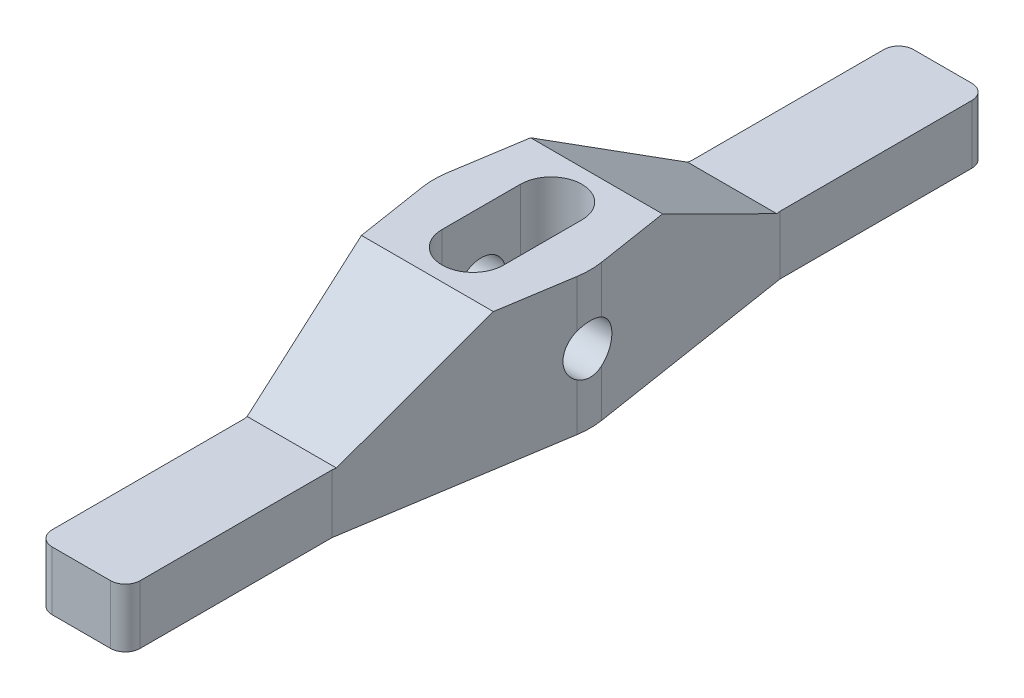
ISO-10303-21;
HEADER;
FILE_DESCRIPTION(('STEP AP214'),'2;1');
FILE_NAME('part.step','',(''),(''),'','','');
FILE_SCHEMA(('AUTOMOTIVE_DESIGN { 1 0 10303 214 1 1 1 1 }'));
ENDSEC;
DATA;
#1=APPLICATION_CONTEXT('core data for automotive mechanical design processes');
#2=APPLICATION_PROTOCOL_DEFINITION('international standard','automotive_design',2000,#1);
#3=PRODUCT_CONTEXT('',#1,'mechanical');
#4=PRODUCT('Part','Part','',(#3));
#5=PRODUCT_RELATED_PRODUCT_CATEGORY('part','',(#4));
#6=PRODUCT_DEFINITION_FORMATION('','',#4);
#7=PRODUCT_DEFINITION_CONTEXT('part definition',#1,'design');
#8=PRODUCT_DEFINITION('design','',#6,#7);
#9=PRODUCT_DEFINITION_SHAPE('','',#8);
#10=(LENGTH_UNIT() NAMED_UNIT(*) SI_UNIT(.MILLI.,.METRE.));
#11=(NAMED_UNIT(*) PLANE_ANGLE_UNIT() SI_UNIT($,.RADIAN.));
#12=(NAMED_UNIT(*) SI_UNIT($,.STERADIAN.) SOLID_ANGLE_UNIT());
#13=UNCERTAINTY_MEASURE_WITH_UNIT(LENGTH_MEASURE(1.E-05),#10,'distance_accuracy_value','');
#14=(GEOMETRIC_REPRESENTATION_CONTEXT(3) GLOBAL_UNCERTAINTY_ASSIGNED_CONTEXT((#13)) GLOBAL_UNIT_ASSIGNED_CONTEXT((#10,
#11,#12)) REPRESENTATION_CONTEXT('',''));
#15=CARTESIAN_POINT('',(0.,0.,0.));
#16=DIRECTION('',(0.,0.,1.));
#17=DIRECTION('',(1.,0.,0.));
#18=AXIS2_PLACEMENT_3D('',#15,#16,#17);
#19=CARTESIAN_POINT('',(0.,44.45,0.));
#20=DIRECTION('',(0.,-1.,0.));
#21=DIRECTION('',(0.,0.,-1.));
#22=AXIS2_PLACEMENT_3D('',#19,#20,#21);
#23=CYLINDRICAL_SURFACE('',#22,25.4);
#24=DIRECTION('',(0.,-1.,0.));
#25=VECTOR('',#24,1.);
#26=CARTESIAN_POINT('',(-25.0913666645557,44.45,3.94757126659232));
#27=LINE('',#26,#25);
#28=CARTESIAN_POINT('',(-25.0913666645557,15.3460595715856,3.94757126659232));
#29=VERTEX_POINT('',#28);
#30=CARTESIAN_POINT('',(-25.0913666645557,0.,3.94757126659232));
#31=VERTEX_POINT('',#30);
#32=EDGE_CURVE('E261',#29,#31,#27,.T.);
#33=ORIENTED_EDGE('',*,*,#32,.F.);
#34=CARTESIAN_POINT('',(-25.0913666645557,15.3460595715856,3.94757126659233));
#35=CARTESIAN_POINT('',(-25.1207433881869,15.2389469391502,3.7609603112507));
#36=CARTESIAN_POINT('',(-25.1486702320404,15.1393573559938,3.56978635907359));
#37=CARTESIAN_POINT('',(-25.2009729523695,14.9558828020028,3.17954184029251));
#38=CARTESIAN_POINT('',(-25.2253482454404,14.872000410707,2.98046998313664));
#39=CARTESIAN_POINT('',(-25.2698809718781,14.7206534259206,2.57577211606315));
#40=CARTESIAN_POINT('',(-25.2900394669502,14.6531846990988,2.37014777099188));
#41=CARTESIAN_POINT('',(-25.3256133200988,14.5352010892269,1.9537038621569));
#42=CARTESIAN_POINT('',(-25.3410290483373,14.4846848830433,1.74288470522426));
#43=CARTESIAN_POINT('',(-25.3667212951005,14.4009806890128,1.31718967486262));
#44=CARTESIAN_POINT('',(-25.376990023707,14.367818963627,1.10230816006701));
#45=CARTESIAN_POINT('',(-25.392072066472,14.3192426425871,0.670354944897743));
#46=CARTESIAN_POINT('',(-25.3968853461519,14.3038281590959,0.453283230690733));
#47=CARTESIAN_POINT('',(-25.4009230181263,14.290892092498,0.0185911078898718));
#48=CARTESIAN_POINT('',(-25.400148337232,14.2933675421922,-0.199029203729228));
#49=CARTESIAN_POINT('',(-25.3930337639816,14.316180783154,-0.63322798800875));
#50=CARTESIAN_POINT('',(-25.3866941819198,14.3365175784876,-0.849806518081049));
#51=CARTESIAN_POINT('',(-25.3687913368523,14.3943262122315,-1.27638845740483));
#52=CARTESIAN_POINT('',(-25.3573259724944,14.4314770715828,-1.4864396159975));
#53=CARTESIAN_POINT('',(-25.3295036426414,14.5224828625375,-1.90255781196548));
#54=CARTESIAN_POINT('',(-25.3131467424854,14.5763375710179,-2.10862490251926));
#55=CARTESIAN_POINT('',(-25.2759897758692,14.7002219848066,-2.51514697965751));
#56=CARTESIAN_POINT('',(-25.2551949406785,14.7702326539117,-2.71560826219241));
#57=CARTESIAN_POINT('',(-25.2096885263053,14.9258856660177,-3.10981332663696));
#58=CARTESIAN_POINT('',(-25.1849789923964,15.0115198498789,-3.3035605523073));
#59=CARTESIAN_POINT('',(-25.147921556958,15.1424573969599,-3.57045021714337));
#60=CARTESIAN_POINT('',(-25.1369446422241,15.1815191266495,-3.64690066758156));
#61=CARTESIAN_POINT('',(-25.1145090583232,15.2620123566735,-3.7983260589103));
#62=CARTESIAN_POINT('',(-25.1030511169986,15.3034403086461,-3.87330299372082));
#63=CARTESIAN_POINT('',(-25.0913666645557,15.3460595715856,-3.94757126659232));
#64=B_SPLINE_CURVE_WITH_KNOTS('',3,(#34,#35,#36,#37,#38,#39,#40,#41,#42,#43,#44,#45,#46,#47,#48,
#49,#50,#51,#52,#53,#54,#55,#56,#57,#58,#59,#60,#61,#62,#63),.UNSPECIFIED.,.F.,.F.,(4,2,2,2,2,2,
2,2,2,2,2,2,2,2,4),(0.,0.651329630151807,1.30276613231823,1.95403841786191,2.6052598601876,
3.25746396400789,3.90967218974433,4.56177224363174,5.21383593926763,5.85394509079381,
6.49404569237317,7.13339589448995,7.77241315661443,8.03202783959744,8.29126293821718),.UNSPECIFIED.);
#65=CARTESIAN_POINT('',(-25.0913666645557,15.3460595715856,-3.94757126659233));
#66=VERTEX_POINT('',#65);
#67=EDGE_CURVE('E406',#29,#66,#64,.T.);
#68=ORIENTED_EDGE('',*,*,#67,.T.);
#69=DIRECTION('',(0.,-1.,0.));
#70=VECTOR('',#69,1.);
#71=CARTESIAN_POINT('',(-25.0913666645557,44.45,-3.94757126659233));
#72=LINE('',#71,#70);
#73=CARTESIAN_POINT('',(-25.0913666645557,0.,-3.94757126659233));
#74=VERTEX_POINT('',#73);
#75=EDGE_CURVE('E265',#66,#74,#72,.T.);
#76=ORIENTED_EDGE('',*,*,#75,.T.);
#77=CARTESIAN_POINT('',(0.,0.,0.));
#78=DIRECTION('',(0.,1.,0.));
#79=DIRECTION('',(0.,0.,1.));
#80=AXIS2_PLACEMENT_3D('',#77,#78,#79);
#81=CIRCLE('',#80,25.4);
#82=EDGE_CURVE('E346',#74,#31,#81,.T.);
#83=ORIENTED_EDGE('',*,*,#82,.T.);
#84=EDGE_LOOP('',(#33,#68,#76,#83));
#85=FACE_BOUND('',#84,.T.);
#86=ADVANCED_FACE('F35',(#85),#23,.T.);
#87=CARTESIAN_POINT('',(0.,44.45,0.));
#88=DIRECTION('',(0.,-1.,0.));
#89=DIRECTION('',(0.,0.,-1.));
#90=AXIS2_PLACEMENT_3D('',#87,#88,#89);
#91=CYLINDRICAL_SURFACE('',#90,25.4);
#92=DIRECTION('',(0.,-1.,0.));
#93=VECTOR('',#92,1.);
#94=CARTESIAN_POINT('',(25.0913666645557,44.45,-3.94757126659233));
#95=LINE('',#94,#93);
#96=CARTESIAN_POINT('',(25.0913666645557,15.3460595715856,-3.94757126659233));
#97=VERTEX_POINT('',#96);
#98=CARTESIAN_POINT('',(25.0913666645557,0.,-3.94757126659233));
#99=VERTEX_POINT('',#98);
#100=EDGE_CURVE('E249',#97,#99,#95,.T.);
#101=ORIENTED_EDGE('',*,*,#100,.F.);
#102=CARTESIAN_POINT('',(25.0913666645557,15.3460595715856,-3.94757126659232));
#103=CARTESIAN_POINT('',(25.1207433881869,15.2389469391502,-3.76096031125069));
#104=CARTESIAN_POINT('',(25.1486702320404,15.1393573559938,-3.56978635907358));
#105=CARTESIAN_POINT('',(25.2009729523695,14.9558828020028,-3.1795418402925));
#106=CARTESIAN_POINT('',(25.2253482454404,14.872000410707,-2.98046998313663));
#107=CARTESIAN_POINT('',(25.2698809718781,14.7206534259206,-2.57577211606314));
#108=CARTESIAN_POINT('',(25.2900394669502,14.6531846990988,-2.37014777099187));
#109=CARTESIAN_POINT('',(25.3256133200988,14.5352010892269,-1.95370386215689));
#110=CARTESIAN_POINT('',(25.3410290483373,14.4846848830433,-1.74288470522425));
#111=CARTESIAN_POINT('',(25.3667212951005,14.4009806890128,-1.31718967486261));
#112=CARTESIAN_POINT('',(25.376990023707,14.367818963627,-1.102308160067));
#113=CARTESIAN_POINT('',(25.392072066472,14.3192426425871,-0.670354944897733));
#114=CARTESIAN_POINT('',(25.3968853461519,14.3038281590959,-0.453283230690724));
#115=CARTESIAN_POINT('',(25.4009230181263,14.290892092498,-0.0185911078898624));
#116=CARTESIAN_POINT('',(25.400148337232,14.2933675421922,0.199029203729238));
#117=CARTESIAN_POINT('',(25.3930337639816,14.316180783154,0.63322798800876));
#118=CARTESIAN_POINT('',(25.3866941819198,14.3365175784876,0.849806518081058));
#119=CARTESIAN_POINT('',(25.3687913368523,14.3943262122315,1.27638845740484));
#120=CARTESIAN_POINT('',(25.3573259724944,14.4314770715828,1.48643961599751));
#121=CARTESIAN_POINT('',(25.3295036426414,14.5224828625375,1.90255781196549));
#122=CARTESIAN_POINT('',(25.3131467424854,14.5763375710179,2.10862490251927));
#123=CARTESIAN_POINT('',(25.2759897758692,14.7002219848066,2.51514697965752));
#124=CARTESIAN_POINT('',(25.2551949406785,14.7702326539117,2.71560826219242));
#125=CARTESIAN_POINT('',(25.2096885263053,14.9258856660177,3.10981332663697));
#126=CARTESIAN_POINT('',(25.1849789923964,15.0115198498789,3.30356055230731));
#127=CARTESIAN_POINT('',(25.147921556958,15.1424573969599,3.57045021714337));
#128=CARTESIAN_POINT('',(25.1369446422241,15.1815191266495,3.64690066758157));
#129=CARTESIAN_POINT('',(25.1145090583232,15.2620123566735,3.79832605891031));
#130=CARTESIAN_POINT('',(25.1030511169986,15.3034403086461,3.87330299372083));
#131=CARTESIAN_POINT('',(25.0913666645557,15.3460595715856,3.94757126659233));
#132=B_SPLINE_CURVE_WITH_KNOTS('',3,(#102,#103,#104,#105,#106,#107,#108,#109,#110,#111,#112,
#113,#114,#115,#116,#117,#118,#119,#120,#121,#122,#123,#124,#125,#126,#127,#128,#129,#130,#131),
.UNSPECIFIED.,.F.,.F.,(4,2,2,2,2,2,2,2,2,2,2,2,2,2,4),(0.,0.651329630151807,1.30276613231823,
1.95403841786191,2.6052598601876,3.25746396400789,3.90967218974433,4.56177224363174,
5.21383593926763,5.85394509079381,6.49404569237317,7.13339589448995,7.77241315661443,
8.03202783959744,8.29126293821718),.UNSPECIFIED.);
#133=CARTESIAN_POINT('',(25.0913666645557,15.3460595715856,3.94757126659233));
#134=VERTEX_POINT('',#133);
#135=EDGE_CURVE('E235',#97,#134,#132,.T.);
#136=ORIENTED_EDGE('',*,*,#135,.T.);
#137=DIRECTION('',(0.,-1.,0.));
#138=VECTOR('',#137,1.);
#139=CARTESIAN_POINT('',(25.0913666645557,44.45,3.94757126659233));
#140=LINE('',#139,#138);
#141=CARTESIAN_POINT('',(25.0913666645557,0.,3.94757126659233));
#142=VERTEX_POINT('',#141);
#143=EDGE_CURVE('E248',#134,#142,#140,.T.);
#144=ORIENTED_EDGE('',*,*,#143,.T.);
#145=CARTESIAN_POINT('',(0.,0.,0.));
#146=DIRECTION('',(0.,1.,0.));
#147=DIRECTION('',(0.,0.,1.));
#148=AXIS2_PLACEMENT_3D('',#145,#146,#147);
#149=CIRCLE('',#148,25.4);
#150=EDGE_CURVE('E354',#142,#99,#149,.T.);
#151=ORIENTED_EDGE('',*,*,#150,.T.);
#152=EDGE_LOOP('',(#101,#136,#144,#151));
#153=FACE_BOUND('',#152,.T.);
#154=ADVANCED_FACE('F449',(#153),#91,.T.);
#155=CARTESIAN_POINT('',(0.,44.45,0.));
#156=DIRECTION('',(0.,1.,0.));
#157=DIRECTION('',(0.,0.,1.));
#158=AXIS2_PLACEMENT_3D('',#155,#156,#157);
#159=PLANE('',#158);
#160=DIRECTION('',(1.,0.,0.));
#161=VECTOR('',#160,1.);
#162=CARTESIAN_POINT('',(-25.4,44.45,27.432));
#163=LINE('',#162,#161);
#164=CARTESIAN_POINT('',(-21.3966115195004,44.45,27.432));
#165=VERTEX_POINT('',#164);
#166=CARTESIAN_POINT('',(21.3966115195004,44.45,27.432));
#167=VERTEX_POINT('',#166);
#168=EDGE_CURVE('E328',#165,#167,#163,.T.);
#169=ORIENTED_EDGE('',*,*,#168,.T.);
#170=DIRECTION('',(0.155416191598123,0.,-0.987849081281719));
#171=VECTOR('',#170,1.);
#172=CARTESIAN_POINT('',(14.2875,44.45,72.6186));
#173=LINE('',#172,#171);
#174=CARTESIAN_POINT('',(25.0913666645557,44.45,3.94757126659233));
#175=VERTEX_POINT('',#174);
#176=EDGE_CURVE('E376',#167,#175,#173,.T.);
#177=ORIENTED_EDGE('',*,*,#176,.T.);
#178=CARTESIAN_POINT('',(0.,44.45,0.));
#179=DIRECTION('',(0.,1.,0.));
#180=DIRECTION('',(0.,0.,1.));
#181=AXIS2_PLACEMENT_3D('',#178,#179,#180);
#182=CIRCLE('',#181,25.4);
#183=CARTESIAN_POINT('',(25.0913666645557,44.45,-3.94757126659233));
#184=VERTEX_POINT('',#183);
#185=EDGE_CURVE('E378',#175,#184,#182,.T.);
#186=ORIENTED_EDGE('',*,*,#185,.T.);
#187=DIRECTION('',(-0.155416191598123,0.,-0.987849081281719));
#188=VECTOR('',#187,1.);
#189=CARTESIAN_POINT('',(14.2875,44.45,-72.6186));
#190=LINE('',#189,#188);
#191=CARTESIAN_POINT('',(21.3966115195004,44.45,-27.432));
#192=VERTEX_POINT('',#191);
#193=EDGE_CURVE('E247',#184,#192,#190,.T.);
#194=ORIENTED_EDGE('',*,*,#193,.T.);
#195=DIRECTION('',(1.,0.,0.));
#196=VECTOR('',#195,1.);
#197=CARTESIAN_POINT('',(-25.4,44.45,-27.432));
#198=LINE('',#197,#196);
#199=CARTESIAN_POINT('',(-21.3966115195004,44.45,-27.432));
#200=VERTEX_POINT('',#199);
#201=EDGE_CURVE('E507',#200,#192,#198,.T.);
#202=ORIENTED_EDGE('',*,*,#201,.F.);
#203=DIRECTION('',(-0.155416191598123,0.,0.987849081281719));
#204=VECTOR('',#203,1.);
#205=CARTESIAN_POINT('',(-14.2875,44.45,-72.6186));
#206=LINE('',#205,#204);
#207=CARTESIAN_POINT('',(-25.0913666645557,44.45,-3.94757126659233));
#208=VERTEX_POINT('',#207);
#209=EDGE_CURVE('E358',#200,#208,#206,.T.);
#210=ORIENTED_EDGE('',*,*,#209,.T.);
#211=CARTESIAN_POINT('',(0.,44.45,0.));
#212=DIRECTION('',(0.,1.,0.));
#213=DIRECTION('',(0.,0.,1.));
#214=AXIS2_PLACEMENT_3D('',#211,#212,#213);
#215=CIRCLE('',#214,25.4);
#216=CARTESIAN_POINT('',(-25.0913666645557,44.45,3.94757126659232));
#217=VERTEX_POINT('',#216);
#218=EDGE_CURVE('E362',#208,#217,#215,.T.);
#219=ORIENTED_EDGE('',*,*,#218,.T.);
#220=DIRECTION('',(0.155416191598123,0.,0.987849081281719));
#221=VECTOR('',#220,1.);
#222=CARTESIAN_POINT('',(-14.2875,44.45,72.6186));
#223=LINE('',#222,#221);
#224=EDGE_CURVE('E368',#217,#165,#223,.T.);
#225=ORIENTED_EDGE('',*,*,#224,.T.);
#226=EDGE_LOOP('',(#169,#177,#186,#194,#202,#210,#219,#225));
#227=FACE_BOUND('',#226,.T.);
#228=DIRECTION('',(0.,0.,1.));
#229=VECTOR('',#228,1.);
#230=CARTESIAN_POINT('',(-9.9949,44.45,-12.7));
#231=LINE('',#230,#229);
#232=CARTESIAN_POINT('',(-9.9949,44.45,-12.7));
#233=VERTEX_POINT('',#232);
#234=CARTESIAN_POINT('',(-9.9949,44.45,12.7));
#235=VERTEX_POINT('',#234);
#236=EDGE_CURVE('E524',#233,#235,#231,.T.);
#237=ORIENTED_EDGE('',*,*,#236,.F.);
#238=CARTESIAN_POINT('',(0.,44.45,-12.7));
#239=DIRECTION('',(0.,1.,0.));
#240=DIRECTION('',(0.,0.,1.));
#241=AXIS2_PLACEMENT_3D('',#238,#239,#240);
#242=CIRCLE('',#241,9.9949);
#243=CARTESIAN_POINT('',(9.9949,44.45,-12.7));
#244=VERTEX_POINT('',#243);
#245=EDGE_CURVE('E522',#244,#233,#242,.T.);
#246=ORIENTED_EDGE('',*,*,#245,.F.);
#247=DIRECTION('',(0.,0.,-1.));
#248=VECTOR('',#247,1.);
#249=CARTESIAN_POINT('',(9.9949,44.45,-12.7));
#250=LINE('',#249,#248);
#251=CARTESIAN_POINT('',(9.9949,44.45,12.7));
#252=VERTEX_POINT('',#251);
#253=EDGE_CURVE('E530',#252,#244,#250,.T.);
#254=ORIENTED_EDGE('',*,*,#253,.F.);
#255=CARTESIAN_POINT('',(0.,44.45,12.7));
#256=DIRECTION('',(0.,1.,0.));
#257=DIRECTION('',(0.,0.,1.));
#258=AXIS2_PLACEMENT_3D('',#255,#256,#257);
#259=CIRCLE('',#258,9.9949);
#260=EDGE_CURVE('E527',#235,#252,#259,.T.);
#261=ORIENTED_EDGE('',*,*,#260,.F.);
#262=EDGE_LOOP('',(#237,#246,#254,#261));
#263=FACE_BOUND('',#262,.T.);
#264=ADVANCED_FACE('F472',(#227,#263),#159,.T.);
#265=CARTESIAN_POINT('',(0.,0.,0.));
#266=DIRECTION('',(0.,1.,0.));
#267=DIRECTION('',(0.,0.,1.));
#268=AXIS2_PLACEMENT_3D('',#265,#266,#267);
#269=PLANE('',#268);
#270=DIRECTION('',(0.,0.,1.));
#271=VECTOR('',#270,1.);
#272=CARTESIAN_POINT('',(-14.2875,0.,-139.7));
#273=LINE('',#272,#271);
#274=CARTESIAN_POINT('',(-14.2875,0.,-134.874));
#275=VERTEX_POINT('',#274);
#276=CARTESIAN_POINT('',(-14.2875,0.,-72.6186));
#277=VERTEX_POINT('',#276);
#278=EDGE_CURVE('E387',#275,#277,#273,.T.);
#279=ORIENTED_EDGE('',*,*,#278,.F.);
#280=CARTESIAN_POINT('',(-9.4615,0.,-134.874));
#281=DIRECTION('',(0.,1.,0.));
#282=DIRECTION('',(0.,0.,1.));
#283=AXIS2_PLACEMENT_3D('',#280,#281,#282);
#284=CIRCLE('',#283,4.826);
#285=CARTESIAN_POINT('',(-9.4615,0.,-139.7));
#286=VERTEX_POINT('',#285);
#287=EDGE_CURVE('E295',#275,#286,#284,.F.);
#288=ORIENTED_EDGE('',*,*,#287,.T.);
#289=DIRECTION('',(-1.,0.,0.));
#290=VECTOR('',#289,1.);
#291=CARTESIAN_POINT('',(-14.2875,0.,-139.7));
#292=LINE('',#291,#290);
#293=CARTESIAN_POINT('',(9.4615,0.,-139.7));
#294=VERTEX_POINT('',#293);
#295=EDGE_CURVE('E384',#294,#286,#292,.T.);
#296=ORIENTED_EDGE('',*,*,#295,.F.);
#297=CARTESIAN_POINT('',(9.4615,0.,-134.874));
#298=DIRECTION('',(0.,1.,0.));
#299=DIRECTION('',(0.,0.,1.));
#300=AXIS2_PLACEMENT_3D('',#297,#298,#299);
#301=CIRCLE('',#300,4.826);
#302=CARTESIAN_POINT('',(14.2875,0.,-134.874));
#303=VERTEX_POINT('',#302);
#304=EDGE_CURVE('E293',#294,#303,#301,.F.);
#305=ORIENTED_EDGE('',*,*,#304,.T.);
#306=DIRECTION('',(0.,0.,-1.));
#307=VECTOR('',#306,1.);
#308=CARTESIAN_POINT('',(14.2875,0.,-139.7));
#309=LINE('',#308,#307);
#310=CARTESIAN_POINT('',(14.2875,0.,-72.6186));
#311=VERTEX_POINT('',#310);
#312=EDGE_CURVE('E381',#311,#303,#309,.T.);
#313=ORIENTED_EDGE('',*,*,#312,.F.);
#314=DIRECTION('',(-0.155416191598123,0.,-0.987849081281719));
#315=VECTOR('',#314,1.);
#316=CARTESIAN_POINT('',(14.2875,0.,-72.6186));
#317=LINE('',#316,#315);
#318=EDGE_CURVE('E356',#99,#311,#317,.T.);
#319=ORIENTED_EDGE('',*,*,#318,.F.);
#320=ORIENTED_EDGE('',*,*,#150,.F.);
#321=DIRECTION('',(0.155416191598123,0.,-0.987849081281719));
#322=VECTOR('',#321,1.);
#323=CARTESIAN_POINT('',(14.2875,0.,72.6186));
#324=LINE('',#323,#322);
#325=CARTESIAN_POINT('',(14.2875,0.,72.6186));
#326=VERTEX_POINT('',#325);
#327=EDGE_CURVE('E351',#326,#142,#324,.T.);
#328=ORIENTED_EDGE('',*,*,#327,.F.);
#329=DIRECTION('',(0.,0.,-1.));
#330=VECTOR('',#329,1.);
#331=CARTESIAN_POINT('',(14.2875,0.,139.7));
#332=LINE('',#331,#330);
#333=CARTESIAN_POINT('',(14.2875,0.,134.874));
#334=VERTEX_POINT('',#333);
#335=EDGE_CURVE('E344',#334,#326,#332,.T.);
#336=ORIENTED_EDGE('',*,*,#335,.F.);
#337=CARTESIAN_POINT('',(9.4615,0.,134.874));
#338=DIRECTION('',(0.,1.,0.));
#339=DIRECTION('',(0.,0.,1.));
#340=AXIS2_PLACEMENT_3D('',#337,#338,#339);
#341=CIRCLE('',#340,4.826);
#342=CARTESIAN_POINT('',(9.4615,0.,139.7));
#343=VERTEX_POINT('',#342);
#344=EDGE_CURVE('E289',#334,#343,#341,.F.);
#345=ORIENTED_EDGE('',*,*,#344,.T.);
#346=DIRECTION('',(1.,0.,0.));
#347=VECTOR('',#346,1.);
#348=CARTESIAN_POINT('',(-14.2875,0.,139.7));
#349=LINE('',#348,#347);
#350=CARTESIAN_POINT('',(-9.4615,0.,139.7));
#351=VERTEX_POINT('',#350);
#352=EDGE_CURVE('E338',#351,#343,#349,.T.);
#353=ORIENTED_EDGE('',*,*,#352,.F.);
#354=CARTESIAN_POINT('',(-9.4615,0.,134.874));
#355=DIRECTION('',(0.,1.,0.));
#356=DIRECTION('',(0.,0.,1.));
#357=AXIS2_PLACEMENT_3D('',#354,#355,#356);
#358=CIRCLE('',#357,4.826);
#359=CARTESIAN_POINT('',(-14.2875,0.,134.874));
#360=VERTEX_POINT('',#359);
#361=EDGE_CURVE('E291',#351,#360,#358,.F.);
#362=ORIENTED_EDGE('',*,*,#361,.T.);
#363=DIRECTION('',(0.,0.,1.));
#364=VECTOR('',#363,1.);
#365=CARTESIAN_POINT('',(-14.2875,0.,139.7));
#366=LINE('',#365,#364);
#367=CARTESIAN_POINT('',(-14.2875,0.,72.6186));
#368=VERTEX_POINT('',#367);
#369=EDGE_CURVE('E337',#368,#360,#366,.T.);
#370=ORIENTED_EDGE('',*,*,#369,.F.);
#371=DIRECTION('',(0.155416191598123,0.,0.987849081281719));
#372=VECTOR('',#371,1.);
#373=CARTESIAN_POINT('',(-14.2875,0.,72.6186));
#374=LINE('',#373,#372);
#375=EDGE_CURVE('E342',#31,#368,#374,.T.);
#376=ORIENTED_EDGE('',*,*,#375,.F.);
#377=ORIENTED_EDGE('',*,*,#82,.F.);
#378=DIRECTION('',(-0.155416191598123,0.,0.987849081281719));
#379=VECTOR('',#378,1.);
#380=CARTESIAN_POINT('',(-14.2875,0.,-72.6186));
#381=LINE('',#380,#379);
#382=EDGE_CURVE('E389',#277,#74,#381,.T.);
#383=ORIENTED_EDGE('',*,*,#382,.F.);
#384=EDGE_LOOP('',(#279,#288,#296,#305,#313,#319,#320,#328,#336,#345,#353,#362,#370,#376,#377,#383));
#385=FACE_BOUND('',#384,.T.);
#386=CARTESIAN_POINT('',(0.,0.,-12.7));
#387=DIRECTION('',(0.,1.,0.));
#388=DIRECTION('',(0.,0.,1.));
#389=AXIS2_PLACEMENT_3D('',#386,#387,#388);
#390=CIRCLE('',#389,9.9949);
#391=CARTESIAN_POINT('',(9.9949,0.,-12.7));
#392=VERTEX_POINT('',#391);
#393=CARTESIAN_POINT('',(-9.9949,0.,-12.7));
#394=VERTEX_POINT('',#393);
#395=EDGE_CURVE('E521',#392,#394,#390,.T.);
#396=ORIENTED_EDGE('',*,*,#395,.T.);
#397=DIRECTION('',(0.,0.,1.));
#398=VECTOR('',#397,1.);
#399=CARTESIAN_POINT('',(-9.9949,0.,-12.7));
#400=LINE('',#399,#398);
#401=CARTESIAN_POINT('',(-9.9949,0.,12.7));
#402=VERTEX_POINT('',#401);
#403=EDGE_CURVE('E535',#394,#402,#400,.T.);
#404=ORIENTED_EDGE('',*,*,#403,.T.);
#405=CARTESIAN_POINT('',(0.,0.,12.7));
#406=DIRECTION('',(0.,1.,0.));
#407=DIRECTION('',(0.,0.,1.));
#408=AXIS2_PLACEMENT_3D('',#405,#406,#407);
#409=CIRCLE('',#408,9.9949);
#410=CARTESIAN_POINT('',(9.9949,0.,12.7));
#411=VERTEX_POINT('',#410);
#412=EDGE_CURVE('E538',#402,#411,#409,.T.);
#413=ORIENTED_EDGE('',*,*,#412,.T.);
#414=DIRECTION('',(0.,0.,-1.));
#415=VECTOR('',#414,1.);
#416=CARTESIAN_POINT('',(9.9949,0.,-12.7));
#417=LINE('',#416,#415);
#418=EDGE_CURVE('E525',#411,#392,#417,.T.);
#419=ORIENTED_EDGE('',*,*,#418,.T.);
#420=EDGE_LOOP('',(#396,#404,#413,#419));
#421=FACE_BOUND('',#420,.T.);
#422=ADVANCED_FACE('F334',(#385,#421),#269,.F.);
#423=CARTESIAN_POINT('',(14.2875,44.45,-139.7));
#424=DIRECTION('',(-1.,0.,0.));
#425=DIRECTION('',(0.,0.,1.));
#426=AXIS2_PLACEMENT_3D('',#423,#424,#425);
#427=PLANE('',#426);
#428=ORIENTED_EDGE('',*,*,#312,.T.);
#429=DIRECTION('',(0.,-1.,0.));
#430=VECTOR('',#429,1.);
#431=CARTESIAN_POINT('',(14.2875,44.45,-134.874));
#432=LINE('',#431,#430);
#433=CARTESIAN_POINT('',(14.2875,19.05,-134.874));
#434=VERTEX_POINT('',#433);
#435=EDGE_CURVE('E306',#303,#434,#432,.F.);
#436=ORIENTED_EDGE('',*,*,#435,.T.);
#437=DIRECTION('',(0.,0.,1.));
#438=VECTOR('',#437,1.);
#439=CARTESIAN_POINT('',(14.2875,19.05,-139.7));
#440=LINE('',#439,#438);
#441=CARTESIAN_POINT('',(14.2875,19.05,-72.6186));
#442=VERTEX_POINT('',#441);
#443=EDGE_CURVE('E497',#434,#442,#440,.T.);
#444=ORIENTED_EDGE('',*,*,#443,.T.);
#445=DIRECTION('',(0.,-1.,0.));
#446=VECTOR('',#445,1.);
#447=CARTESIAN_POINT('',(14.2875,44.45,-72.6186));
#448=LINE('',#447,#446);
#449=EDGE_CURVE('E252',#442,#311,#448,.T.);
#450=ORIENTED_EDGE('',*,*,#449,.T.);
#451=EDGE_LOOP('',(#428,#436,#444,#450));
#452=FACE_BOUND('',#451,.T.);
#453=ADVANCED_FACE('F484',(#452),#427,.F.);
#454=CARTESIAN_POINT('',(-14.2875,44.45,-139.7));
#455=DIRECTION('',(0.,0.,1.));
#456=DIRECTION('',(1.,0.,0.));
#457=AXIS2_PLACEMENT_3D('',#454,#455,#456);
#458=PLANE('',#457);
#459=ORIENTED_EDGE('',*,*,#295,.T.);
#460=DIRECTION('',(0.,-1.,0.));
#461=VECTOR('',#460,1.);
#462=CARTESIAN_POINT('',(-9.4615,44.45,-139.7));
#463=LINE('',#462,#461);
#464=CARTESIAN_POINT('',(-9.4615,19.05,-139.7));
#465=VERTEX_POINT('',#464);
#466=EDGE_CURVE('E300',#286,#465,#463,.F.);
#467=ORIENTED_EDGE('',*,*,#466,.T.);
#468=DIRECTION('',(1.,0.,0.));
#469=VECTOR('',#468,1.);
#470=CARTESIAN_POINT('',(-25.4,19.05,-139.7));
#471=LINE('',#470,#469);
#472=CARTESIAN_POINT('',(9.4615,19.05,-139.7));
#473=VERTEX_POINT('',#472);
#474=EDGE_CURVE('E494',#465,#473,#471,.T.);
#475=ORIENTED_EDGE('',*,*,#474,.T.);
#476=DIRECTION('',(0.,-1.,0.));
#477=VECTOR('',#476,1.);
#478=CARTESIAN_POINT('',(9.4615,44.45,-139.7));
#479=LINE('',#478,#477);
#480=EDGE_CURVE('E297',#473,#294,#479,.T.);
#481=ORIENTED_EDGE('',*,*,#480,.T.);
#482=EDGE_LOOP('',(#459,#467,#475,#481));
#483=FACE_BOUND('',#482,.T.);
#484=ADVANCED_FACE('F499',(#483),#458,.F.);
#485=CARTESIAN_POINT('',(-14.2875,44.45,-139.7));
#486=DIRECTION('',(1.,0.,0.));
#487=DIRECTION('',(0.,0.,-1.));
#488=AXIS2_PLACEMENT_3D('',#485,#486,#487);
#489=PLANE('',#488);
#490=DIRECTION('',(0.,0.,-1.));
#491=VECTOR('',#490,1.);
#492=CARTESIAN_POINT('',(-14.2875,19.05,-139.7));
#493=LINE('',#492,#491);
#494=CARTESIAN_POINT('',(-14.2875,19.05,-72.6186));
#495=VERTEX_POINT('',#494);
#496=CARTESIAN_POINT('',(-14.2875,19.05,-134.874));
#497=VERTEX_POINT('',#496);
#498=EDGE_CURVE('E518',#495,#497,#493,.T.);
#499=ORIENTED_EDGE('',*,*,#498,.T.);
#500=DIRECTION('',(0.,-1.,0.));
#501=VECTOR('',#500,1.);
#502=CARTESIAN_POINT('',(-14.2875,44.45,-134.874));
#503=LINE('',#502,#501);
#504=EDGE_CURVE('E283',#497,#275,#503,.T.);
#505=ORIENTED_EDGE('',*,*,#504,.T.);
#506=ORIENTED_EDGE('',*,*,#278,.T.);
#507=DIRECTION('',(0.,-1.,0.));
#508=VECTOR('',#507,1.);
#509=CARTESIAN_POINT('',(-14.2875,44.45,-72.6186));
#510=LINE('',#509,#508);
#511=EDGE_CURVE('E269',#495,#277,#510,.T.);
#512=ORIENTED_EDGE('',*,*,#511,.F.);
#513=EDGE_LOOP('',(#499,#505,#506,#512));
#514=FACE_BOUND('',#513,.T.);
#515=ADVANCED_FACE('F587',(#514),#489,.F.);
#516=CARTESIAN_POINT('',(-14.2875,44.45,-72.6186));
#517=DIRECTION('',(0.987849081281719,0.,0.155416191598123));
#518=DIRECTION('',(0.155416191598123,0.,-0.987849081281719));
#519=AXIS2_PLACEMENT_3D('',#516,#517,#518);
#520=PLANE('',#519);
#521=ORIENTED_EDGE('',*,*,#75,.F.);
#522=CARTESIAN_POINT('',(-25.7124296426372,22.225,0.));
#523=DIRECTION('',(0.987849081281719,0.,0.155416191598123));
#524=DIRECTION('',(0.155416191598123,0.,-0.987849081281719));
#525=AXIS2_PLACEMENT_3D('',#522,#523,#524);
#526=ELLIPSE('',#525,8.02870615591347,7.93115);
#527=CARTESIAN_POINT('',(-25.0913666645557,29.1039404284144,-3.94757126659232));
#528=VERTEX_POINT('',#527);
#529=EDGE_CURVE('E615',#66,#528,#526,.T.);
#530=ORIENTED_EDGE('',*,*,#529,.T.);
#531=EDGE_CURVE('E266',#208,#528,#72,.T.);
#532=ORIENTED_EDGE('',*,*,#531,.F.);
#533=ORIENTED_EDGE('',*,*,#209,.F.);
#534=DIRECTION('',(0.135002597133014,-0.49542262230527,-0.858097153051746));
#535=VECTOR('',#534,1.);
#536=CARTESIAN_POINT('',(-16.0323857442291,24.7647579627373,-61.5278393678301));
#537=LINE('',#536,#535);
#538=CARTESIAN_POINT('',(-14.4751149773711,19.05,-71.4260905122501));
#539=VERTEX_POINT('',#538);
#540=EDGE_CURVE('E501',#200,#539,#537,.T.);
#541=ORIENTED_EDGE('',*,*,#540,.T.);
#542=DIRECTION('',(0.155416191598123,0.,-0.987849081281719));
#543=VECTOR('',#542,1.);
#544=CARTESIAN_POINT('',(-14.2875,19.05,-72.6186));
#545=LINE('',#544,#543);
#546=EDGE_CURVE('E515',#539,#495,#545,.T.);
#547=ORIENTED_EDGE('',*,*,#546,.T.);
#548=ORIENTED_EDGE('',*,*,#511,.T.);
#549=ORIENTED_EDGE('',*,*,#382,.T.);
#550=EDGE_LOOP('',(#521,#530,#532,#533,#541,#547,#548,#549));
#551=FACE_BOUND('',#550,.T.);
#552=ADVANCED_FACE('F466',(#551),#520,.F.);
#553=ORIENTED_EDGE('',*,*,#531,.T.);
#554=CARTESIAN_POINT('',(-25.0913666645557,29.1039404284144,-3.94757126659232));
#555=CARTESIAN_POINT('',(-25.1207433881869,29.2110530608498,-3.76096031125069));
#556=CARTESIAN_POINT('',(-25.1486702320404,29.3106426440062,-3.56978635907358));
#557=CARTESIAN_POINT('',(-25.2009729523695,29.4941171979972,-3.1795418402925));
#558=CARTESIAN_POINT('',(-25.2253482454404,29.577999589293,-2.98046998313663));
#559=CARTESIAN_POINT('',(-25.2698809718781,29.7293465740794,-2.57577211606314));
#560=CARTESIAN_POINT('',(-25.2900394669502,29.7968153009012,-2.37014777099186));
#561=CARTESIAN_POINT('',(-25.3256133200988,29.9147989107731,-1.95370386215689));
#562=CARTESIAN_POINT('',(-25.3410290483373,29.9653151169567,-1.74288470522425));
#563=CARTESIAN_POINT('',(-25.3667212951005,30.0490193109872,-1.31718967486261));
#564=CARTESIAN_POINT('',(-25.376990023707,30.082181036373,-1.102308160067));
#565=CARTESIAN_POINT('',(-25.392072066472,30.1307573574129,-0.67035494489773));
#566=CARTESIAN_POINT('',(-25.3968853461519,30.1461718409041,-0.45328323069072));
#567=CARTESIAN_POINT('',(-25.4009230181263,30.159107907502,-0.018591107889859));
#568=CARTESIAN_POINT('',(-25.400148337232,30.1566324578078,0.199029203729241));
#569=CARTESIAN_POINT('',(-25.3930337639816,30.133819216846,0.633227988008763));
#570=CARTESIAN_POINT('',(-25.3866941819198,30.1134824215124,0.849806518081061));
#571=CARTESIAN_POINT('',(-25.3687913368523,30.0556737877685,1.27638845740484));
#572=CARTESIAN_POINT('',(-25.3573259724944,30.0185229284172,1.48643961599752));
#573=CARTESIAN_POINT('',(-25.3295036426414,29.9275171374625,1.90255781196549));
#574=CARTESIAN_POINT('',(-25.3131467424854,29.8736624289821,2.10862490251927));
#575=CARTESIAN_POINT('',(-25.2759897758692,29.7497780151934,2.51514697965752));
#576=CARTESIAN_POINT('',(-25.2551949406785,29.6797673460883,2.71560826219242));
#577=CARTESIAN_POINT('',(-25.2096885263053,29.5241143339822,3.10981332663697));
#578=CARTESIAN_POINT('',(-25.1849789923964,29.4384801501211,3.30356055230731));
#579=CARTESIAN_POINT('',(-25.147921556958,29.3075426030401,3.57045021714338));
#580=CARTESIAN_POINT('',(-25.1369446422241,29.2684808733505,3.64690066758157));
#581=CARTESIAN_POINT('',(-25.1145090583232,29.1879876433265,3.79832605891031));
#582=CARTESIAN_POINT('',(-25.1030511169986,29.1465596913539,3.87330299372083));
#583=CARTESIAN_POINT('',(-25.0913666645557,29.1039404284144,3.94757126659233));
#584=B_SPLINE_CURVE_WITH_KNOTS('',3,(#554,#555,#556,#557,#558,#559,#560,#561,#562,#563,#564,
#565,#566,#567,#568,#569,#570,#571,#572,#573,#574,#575,#576,#577,#578,#579,#580,#581,#582,#583),
.UNSPECIFIED.,.F.,.F.,(4,2,2,2,2,2,2,2,2,2,2,2,2,2,4),(0.,0.651329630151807,1.30276613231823,
1.95403841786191,2.60525986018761,3.25746396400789,3.90967218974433,4.56177224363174,
5.21383593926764,5.85394509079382,6.49404569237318,7.13339589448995,7.77241315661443,
8.03202783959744,8.29126293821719),.UNSPECIFIED.);
#585=CARTESIAN_POINT('',(-25.0913666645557,29.1039404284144,3.94757126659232));
#586=VERTEX_POINT('',#585);
#587=EDGE_CURVE('E408',#528,#586,#584,.T.);
#588=ORIENTED_EDGE('',*,*,#587,.T.);
#589=EDGE_CURVE('E262',#217,#586,#27,.T.);
#590=ORIENTED_EDGE('',*,*,#589,.F.);
#591=ORIENTED_EDGE('',*,*,#218,.F.);
#592=EDGE_LOOP('',(#553,#588,#590,#591));
#593=FACE_BOUND('',#592,.T.);
#594=ADVANCED_FACE('F421',(#593),#23,.T.);
#595=CARTESIAN_POINT('',(-14.2875,44.45,72.6186));
#596=DIRECTION('',(0.987849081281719,0.,-0.155416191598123));
#597=DIRECTION('',(-0.155416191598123,0.,-0.987849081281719));
#598=AXIS2_PLACEMENT_3D('',#595,#596,#597);
#599=PLANE('',#598);
#600=ORIENTED_EDGE('',*,*,#589,.T.);
#601=CARTESIAN_POINT('',(-25.7124296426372,22.225,0.));
#602=DIRECTION('',(0.987849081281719,0.,-0.155416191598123));
#603=DIRECTION('',(0.155416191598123,0.,0.987849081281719));
#604=AXIS2_PLACEMENT_3D('',#601,#602,#603);
#605=ELLIPSE('',#604,8.02870615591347,7.93115);
#606=EDGE_CURVE('E402',#586,#29,#605,.T.);
#607=ORIENTED_EDGE('',*,*,#606,.T.);
#608=ORIENTED_EDGE('',*,*,#32,.T.);
#609=ORIENTED_EDGE('',*,*,#375,.T.);
#610=DIRECTION('',(0.,-1.,0.));
#611=VECTOR('',#610,1.);
#612=CARTESIAN_POINT('',(-14.2875,44.45,72.6186));
#613=LINE('',#612,#611);
#614=CARTESIAN_POINT('',(-14.2875,19.05,72.6186));
#615=VERTEX_POINT('',#614);
#616=EDGE_CURVE('E259',#615,#368,#613,.T.);
#617=ORIENTED_EDGE('',*,*,#616,.F.);
#618=DIRECTION('',(-0.155416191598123,0.,-0.987849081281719));
#619=VECTOR('',#618,1.);
#620=CARTESIAN_POINT('',(-14.2875,19.05,72.6186));
#621=LINE('',#620,#619);
#622=CARTESIAN_POINT('',(-14.4751149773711,19.05,71.4260905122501));
#623=VERTEX_POINT('',#622);
#624=EDGE_CURVE('E510',#615,#623,#621,.T.);
#625=ORIENTED_EDGE('',*,*,#624,.T.);
#626=DIRECTION('',(-0.135002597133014,0.49542262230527,-0.858097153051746));
#627=VECTOR('',#626,1.);
#628=CARTESIAN_POINT('',(-16.0323857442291,24.7647579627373,61.5278393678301));
#629=LINE('',#628,#627);
#630=EDGE_CURVE('E327',#623,#165,#629,.T.);
#631=ORIENTED_EDGE('',*,*,#630,.T.);
#632=ORIENTED_EDGE('',*,*,#224,.F.);
#633=EDGE_LOOP('',(#600,#607,#608,#609,#617,#625,#631,#632));
#634=FACE_BOUND('',#633,.T.);
#635=ADVANCED_FACE('F398',(#634),#599,.F.);
#636=CARTESIAN_POINT('',(-14.2875,44.45,139.7));
#637=DIRECTION('',(1.,0.,0.));
#638=DIRECTION('',(0.,0.,-1.));
#639=AXIS2_PLACEMENT_3D('',#636,#637,#638);
#640=PLANE('',#639);
#641=ORIENTED_EDGE('',*,*,#369,.T.);
#642=DIRECTION('',(0.,-1.,0.));
#643=VECTOR('',#642,1.);
#644=CARTESIAN_POINT('',(-14.2875,44.45,134.874));
#645=LINE('',#644,#643);
#646=CARTESIAN_POINT('',(-14.2875,19.05,134.874));
#647=VERTEX_POINT('',#646);
#648=EDGE_CURVE('E58',#360,#647,#645,.F.);
#649=ORIENTED_EDGE('',*,*,#648,.T.);
#650=DIRECTION('',(0.,0.,-1.));
#651=VECTOR('',#650,1.);
#652=CARTESIAN_POINT('',(-14.2875,19.05,139.7));
#653=LINE('',#652,#651);
#654=EDGE_CURVE('E319',#647,#615,#653,.T.);
#655=ORIENTED_EDGE('',*,*,#654,.T.);
#656=ORIENTED_EDGE('',*,*,#616,.T.);
#657=EDGE_LOOP('',(#641,#649,#655,#656));
#658=FACE_BOUND('',#657,.T.);
#659=ADVANCED_FACE('F339',(#658),#640,.F.);
#660=CARTESIAN_POINT('',(-14.2875,44.45,139.7));
#661=DIRECTION('',(0.,0.,-1.));
#662=DIRECTION('',(-1.,0.,0.));
#663=AXIS2_PLACEMENT_3D('',#660,#661,#662);
#664=PLANE('',#663);
#665=DIRECTION('',(1.,0.,0.));
#666=VECTOR('',#665,1.);
#667=CARTESIAN_POINT('',(-25.4,19.05,139.7));
#668=LINE('',#667,#666);
#669=CARTESIAN_POINT('',(-9.4615,19.05,139.7));
#670=VERTEX_POINT('',#669);
#671=CARTESIAN_POINT('',(9.4615,19.05,139.7));
#672=VERTEX_POINT('',#671);
#673=EDGE_CURVE('E317',#670,#672,#668,.T.);
#674=ORIENTED_EDGE('',*,*,#673,.F.);
#675=DIRECTION('',(0.,-1.,0.));
#676=VECTOR('',#675,1.);
#677=CARTESIAN_POINT('',(-9.4615,44.45,139.7));
#678=LINE('',#677,#676);
#679=EDGE_CURVE('E310',#670,#351,#678,.T.);
#680=ORIENTED_EDGE('',*,*,#679,.T.);
#681=ORIENTED_EDGE('',*,*,#352,.T.);
#682=DIRECTION('',(0.,-1.,0.));
#683=VECTOR('',#682,1.);
#684=CARTESIAN_POINT('',(9.4615,44.45,139.7));
#685=LINE('',#684,#683);
#686=EDGE_CURVE('E308',#343,#672,#685,.F.);
#687=ORIENTED_EDGE('',*,*,#686,.T.);
#688=EDGE_LOOP('',(#674,#680,#681,#687));
#689=FACE_BOUND('',#688,.T.);
#690=ADVANCED_FACE('F323',(#689),#664,.F.);
#691=CARTESIAN_POINT('',(14.2875,44.45,139.7));
#692=DIRECTION('',(-1.,0.,0.));
#693=DIRECTION('',(0.,0.,1.));
#694=AXIS2_PLACEMENT_3D('',#691,#692,#693);
#695=PLANE('',#694);
#696=DIRECTION('',(0.,0.,1.));
#697=VECTOR('',#696,1.);
#698=CARTESIAN_POINT('',(14.2875,19.05,139.7));
#699=LINE('',#698,#697);
#700=CARTESIAN_POINT('',(14.2875,19.05,72.6186));
#701=VERTEX_POINT('',#700);
#702=CARTESIAN_POINT('',(14.2875,19.05,134.874));
#703=VERTEX_POINT('',#702);
#704=EDGE_CURVE('E605',#701,#703,#699,.T.);
#705=ORIENTED_EDGE('',*,*,#704,.T.);
#706=DIRECTION('',(0.,-1.,0.));
#707=VECTOR('',#706,1.);
#708=CARTESIAN_POINT('',(14.2875,44.45,134.874));
#709=LINE('',#708,#707);
#710=EDGE_CURVE('E11',#703,#334,#709,.T.);
#711=ORIENTED_EDGE('',*,*,#710,.T.);
#712=ORIENTED_EDGE('',*,*,#335,.T.);
#713=DIRECTION('',(0.,-1.,0.));
#714=VECTOR('',#713,1.);
#715=CARTESIAN_POINT('',(14.2875,44.45,72.6186));
#716=LINE('',#715,#714);
#717=EDGE_CURVE('E256',#701,#326,#716,.T.);
#718=ORIENTED_EDGE('',*,*,#717,.F.);
#719=EDGE_LOOP('',(#705,#711,#712,#718));
#720=FACE_BOUND('',#719,.T.);
#721=ADVANCED_FACE('F454',(#720),#695,.F.);
#722=CARTESIAN_POINT('',(14.2875,44.45,72.6186));
#723=DIRECTION('',(-0.987849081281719,0.,-0.155416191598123));
#724=DIRECTION('',(-0.155416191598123,0.,0.987849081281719));
#725=AXIS2_PLACEMENT_3D('',#722,#723,#724);
#726=PLANE('',#725);
#727=ORIENTED_EDGE('',*,*,#143,.F.);
#728=CARTESIAN_POINT('',(25.7124296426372,22.225,0.));
#729=DIRECTION('',(-0.987849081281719,0.,-0.155416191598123));
#730=DIRECTION('',(0.155416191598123,0.,-0.987849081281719));
#731=AXIS2_PLACEMENT_3D('',#728,#729,#730);
#732=ELLIPSE('',#731,8.02870615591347,7.93115);
#733=CARTESIAN_POINT('',(25.0913666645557,29.1039404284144,3.94757126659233));
#734=VERTEX_POINT('',#733);
#735=EDGE_CURVE('E234',#134,#734,#732,.T.);
#736=ORIENTED_EDGE('',*,*,#735,.T.);
#737=EDGE_CURVE('E230',#175,#734,#140,.T.);
#738=ORIENTED_EDGE('',*,*,#737,.F.);
#739=ORIENTED_EDGE('',*,*,#176,.F.);
#740=DIRECTION('',(-0.135002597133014,-0.49542262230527,0.858097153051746));
#741=VECTOR('',#740,1.);
#742=CARTESIAN_POINT('',(16.0323857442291,24.7647579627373,61.5278393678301));
#743=LINE('',#742,#741);
#744=CARTESIAN_POINT('',(14.4751149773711,19.05,71.4260905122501));
#745=VERTEX_POINT('',#744);
#746=EDGE_CURVE('E277',#167,#745,#743,.T.);
#747=ORIENTED_EDGE('',*,*,#746,.T.);
#748=DIRECTION('',(-0.155416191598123,0.,0.987849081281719));
#749=VECTOR('',#748,1.);
#750=CARTESIAN_POINT('',(14.2875,19.05,72.6186));
#751=LINE('',#750,#749);
#752=EDGE_CURVE('E280',#745,#701,#751,.T.);
#753=ORIENTED_EDGE('',*,*,#752,.T.);
#754=ORIENTED_EDGE('',*,*,#717,.T.);
#755=ORIENTED_EDGE('',*,*,#327,.T.);
#756=EDGE_LOOP('',(#727,#736,#738,#739,#747,#753,#754,#755));
#757=FACE_BOUND('',#756,.T.);
#758=ADVANCED_FACE('F448',(#757),#726,.F.);
#759=ORIENTED_EDGE('',*,*,#737,.T.);
#760=CARTESIAN_POINT('',(25.0913666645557,29.1039404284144,3.94757126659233));
#761=CARTESIAN_POINT('',(25.1207433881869,29.2110530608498,3.76096031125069));
#762=CARTESIAN_POINT('',(25.1486702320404,29.3106426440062,3.56978635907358));
#763=CARTESIAN_POINT('',(25.2009729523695,29.4941171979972,3.17954184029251));
#764=CARTESIAN_POINT('',(25.2253482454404,29.577999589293,2.98046998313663));
#765=CARTESIAN_POINT('',(25.2698809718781,29.7293465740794,2.57577211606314));
#766=CARTESIAN_POINT('',(25.2900394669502,29.7968153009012,2.37014777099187));
#767=CARTESIAN_POINT('',(25.3256133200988,29.9147989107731,1.95370386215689));
#768=CARTESIAN_POINT('',(25.3410290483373,29.9653151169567,1.74288470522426));
#769=CARTESIAN_POINT('',(25.3667212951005,30.0490193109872,1.31718967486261));
#770=CARTESIAN_POINT('',(25.376990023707,30.082181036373,1.10230816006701));
#771=CARTESIAN_POINT('',(25.392072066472,30.1307573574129,0.670354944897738));
#772=CARTESIAN_POINT('',(25.3968853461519,30.1461718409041,0.453283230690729));
#773=CARTESIAN_POINT('',(25.4009230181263,30.159107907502,0.0185911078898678));
#774=CARTESIAN_POINT('',(25.400148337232,30.1566324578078,-0.199029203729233));
#775=CARTESIAN_POINT('',(25.3930337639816,30.133819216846,-0.633227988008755));
#776=CARTESIAN_POINT('',(25.3866941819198,30.1134824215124,-0.849806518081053));
#777=CARTESIAN_POINT('',(25.3687913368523,30.0556737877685,-1.27638845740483));
#778=CARTESIAN_POINT('',(25.3573259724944,30.0185229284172,-1.48643961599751));
#779=CARTESIAN_POINT('',(25.3295036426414,29.9275171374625,-1.90255781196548));
#780=CARTESIAN_POINT('',(25.3131467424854,29.8736624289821,-2.10862490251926));
#781=CARTESIAN_POINT('',(25.2759897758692,29.7497780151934,-2.51514697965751));
#782=CARTESIAN_POINT('',(25.2551949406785,29.6797673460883,-2.71560826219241));
#783=CARTESIAN_POINT('',(25.2096885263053,29.5241143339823,-3.10981332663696));
#784=CARTESIAN_POINT('',(25.1849789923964,29.4384801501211,-3.30356055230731));
#785=CARTESIAN_POINT('',(25.147921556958,29.3075426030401,-3.57045021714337));
#786=CARTESIAN_POINT('',(25.1369446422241,29.2684808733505,-3.64690066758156));
#787=CARTESIAN_POINT('',(25.1145090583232,29.1879876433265,-3.79832605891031));
#788=CARTESIAN_POINT('',(25.1030511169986,29.1465596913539,-3.87330299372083));
#789=CARTESIAN_POINT('',(25.0913666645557,29.1039404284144,-3.94757126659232));
#790=B_SPLINE_CURVE_WITH_KNOTS('',3,(#760,#761,#762,#763,#764,#765,#766,#767,#768,#769,#770,
#771,#772,#773,#774,#775,#776,#777,#778,#779,#780,#781,#782,#783,#784,#785,#786,#787,#788,#789),
.UNSPECIFIED.,.F.,.F.,(4,2,2,2,2,2,2,2,2,2,2,2,2,2,4),(0.,0.651329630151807,1.30276613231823,
1.95403841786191,2.6052598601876,3.25746396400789,3.90967218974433,4.56177224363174,
5.21383593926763,5.85394509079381,6.49404569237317,7.13339589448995,7.77241315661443,
8.03202783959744,8.29126293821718),.UNSPECIFIED.);
#791=CARTESIAN_POINT('',(25.0913666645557,29.1039404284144,-3.94757126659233));
#792=VERTEX_POINT('',#791);
#793=EDGE_CURVE('E222',#734,#792,#790,.T.);
#794=ORIENTED_EDGE('',*,*,#793,.T.);
#795=EDGE_CURVE('E227',#184,#792,#95,.T.);
#796=ORIENTED_EDGE('',*,*,#795,.F.);
#797=ORIENTED_EDGE('',*,*,#185,.F.);
#798=EDGE_LOOP('',(#759,#794,#796,#797));
#799=FACE_BOUND('',#798,.T.);
#800=ADVANCED_FACE('F224',(#799),#91,.T.);
#801=CARTESIAN_POINT('',(14.2875,44.45,-72.6186));
#802=DIRECTION('',(-0.987849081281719,0.,0.155416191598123));
#803=DIRECTION('',(0.155416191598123,0.,0.987849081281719));
#804=AXIS2_PLACEMENT_3D('',#801,#802,#803);
#805=PLANE('',#804);
#806=ORIENTED_EDGE('',*,*,#795,.T.);
#807=CARTESIAN_POINT('',(25.7124296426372,22.225,0.));
#808=DIRECTION('',(-0.987849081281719,0.,0.155416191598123));
#809=DIRECTION('',(0.155416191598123,0.,0.987849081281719));
#810=AXIS2_PLACEMENT_3D('',#807,#808,#809);
#811=ELLIPSE('',#810,8.02870615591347,7.93115);
#812=EDGE_CURVE('E238',#792,#97,#811,.T.);
#813=ORIENTED_EDGE('',*,*,#812,.T.);
#814=ORIENTED_EDGE('',*,*,#100,.T.);
#815=ORIENTED_EDGE('',*,*,#318,.T.);
#816=ORIENTED_EDGE('',*,*,#449,.F.);
#817=DIRECTION('',(0.155416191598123,0.,0.987849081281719));
#818=VECTOR('',#817,1.);
#819=CARTESIAN_POINT('',(14.2875,19.05,-72.6186));
#820=LINE('',#819,#818);
#821=CARTESIAN_POINT('',(14.4751149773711,19.05,-71.4260905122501));
#822=VERTEX_POINT('',#821);
#823=EDGE_CURVE('E274',#442,#822,#820,.T.);
#824=ORIENTED_EDGE('',*,*,#823,.T.);
#825=DIRECTION('',(0.135002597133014,0.49542262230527,0.858097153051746));
#826=VECTOR('',#825,1.);
#827=CARTESIAN_POINT('',(16.0323857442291,24.7647579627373,-61.5278393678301));
#828=LINE('',#827,#826);
#829=EDGE_CURVE('E272',#822,#192,#828,.T.);
#830=ORIENTED_EDGE('',*,*,#829,.T.);
#831=ORIENTED_EDGE('',*,*,#193,.F.);
#832=EDGE_LOOP('',(#806,#813,#814,#815,#816,#824,#830,#831));
#833=FACE_BOUND('',#832,.T.);
#834=ADVANCED_FACE('F244',(#833),#805,.F.);
#835=CARTESIAN_POINT('',(0.,44.45,-12.7));
#836=DIRECTION('',(0.,-1.,0.));
#837=DIRECTION('',(0.,0.,-1.));
#838=AXIS2_PLACEMENT_3D('',#835,#836,#837);
#839=CYLINDRICAL_SURFACE('',#838,9.9949);
#840=ORIENTED_EDGE('',*,*,#395,.F.);
#841=DIRECTION('',(0.,-1.,0.));
#842=VECTOR('',#841,1.);
#843=CARTESIAN_POINT('',(9.9949,44.45,-12.7));
#844=LINE('',#843,#842);
#845=EDGE_CURVE('E532',#244,#392,#844,.T.);
#846=ORIENTED_EDGE('',*,*,#845,.F.);
#847=ORIENTED_EDGE('',*,*,#245,.T.);
#848=DIRECTION('',(0.,-1.,0.));
#849=VECTOR('',#848,1.);
#850=CARTESIAN_POINT('',(-9.9949,44.45,-12.7));
#851=LINE('',#850,#849);
#852=EDGE_CURVE('E371',#233,#394,#851,.T.);
#853=ORIENTED_EDGE('',*,*,#852,.T.);
#854=EDGE_LOOP('',(#840,#846,#847,#853));
#855=FACE_BOUND('',#854,.T.);
#856=ADVANCED_FACE('F553',(#855),#839,.F.);
#857=CARTESIAN_POINT('',(-9.9949,44.45,-12.7));
#858=DIRECTION('',(1.,0.,0.));
#859=DIRECTION('',(0.,0.,-1.));
#860=AXIS2_PLACEMENT_3D('',#857,#858,#859);
#861=PLANE('',#860);
#862=CARTESIAN_POINT('',(-9.9949,22.225,0.));
#863=DIRECTION('',(1.,0.,0.));
#864=DIRECTION('',(0.,0.,-1.));
#865=AXIS2_PLACEMENT_3D('',#862,#863,#864);
#866=CIRCLE('',#865,7.93115);
#867=CARTESIAN_POINT('',(-9.9949,22.225,-7.93115));
#868=VERTEX_POINT('',#867);
#869=EDGE_CURVE('E242',#868,#868,#866,.T.);
#870=ORIENTED_EDGE('',*,*,#869,.F.);
#871=EDGE_LOOP('',(#870));
#872=FACE_BOUND('',#871,.T.);
#873=ORIENTED_EDGE('',*,*,#403,.F.);
#874=ORIENTED_EDGE('',*,*,#852,.F.);
#875=ORIENTED_EDGE('',*,*,#236,.T.);
#876=DIRECTION('',(0.,-1.,0.));
#877=VECTOR('',#876,1.);
#878=CARTESIAN_POINT('',(-9.9949,44.45,12.7));
#879=LINE('',#878,#877);
#880=EDGE_CURVE('E546',#235,#402,#879,.T.);
#881=ORIENTED_EDGE('',*,*,#880,.T.);
#882=EDGE_LOOP('',(#873,#874,#875,#881));
#883=FACE_BOUND('',#882,.T.);
#884=ADVANCED_FACE('F563',(#872,#883),#861,.T.);
#885=CARTESIAN_POINT('',(0.,44.45,12.7));
#886=DIRECTION('',(0.,-1.,0.));
#887=DIRECTION('',(0.,0.,-1.));
#888=AXIS2_PLACEMENT_3D('',#885,#886,#887);
#889=CYLINDRICAL_SURFACE('',#888,9.9949);
#890=ORIENTED_EDGE('',*,*,#412,.F.);
#891=ORIENTED_EDGE('',*,*,#880,.F.);
#892=ORIENTED_EDGE('',*,*,#260,.T.);
#893=DIRECTION('',(0.,-1.,0.));
#894=VECTOR('',#893,1.);
#895=CARTESIAN_POINT('',(9.9949,44.45,12.7));
#896=LINE('',#895,#894);
#897=EDGE_CURVE('E545',#252,#411,#896,.T.);
#898=ORIENTED_EDGE('',*,*,#897,.T.);
#899=EDGE_LOOP('',(#890,#891,#892,#898));
#900=FACE_BOUND('',#899,.T.);
#901=ADVANCED_FACE('F565',(#900),#889,.F.);
#902=CARTESIAN_POINT('',(9.9949,44.45,-12.7));
#903=DIRECTION('',(-1.,0.,0.));
#904=DIRECTION('',(0.,0.,1.));
#905=AXIS2_PLACEMENT_3D('',#902,#903,#904);
#906=PLANE('',#905);
#907=CARTESIAN_POINT('',(9.9949,22.225,0.));
#908=DIRECTION('',(-1.,0.,0.));
#909=DIRECTION('',(0.,0.,1.));
#910=AXIS2_PLACEMENT_3D('',#907,#908,#909);
#911=CIRCLE('',#910,7.93115);
#912=CARTESIAN_POINT('',(9.9949,22.225,7.93115));
#913=VERTEX_POINT('',#912);
#914=EDGE_CURVE('E284',#913,#913,#911,.T.);
#915=ORIENTED_EDGE('',*,*,#914,.F.);
#916=EDGE_LOOP('',(#915));
#917=FACE_BOUND('',#916,.T.);
#918=ORIENTED_EDGE('',*,*,#418,.F.);
#919=ORIENTED_EDGE('',*,*,#897,.F.);
#920=ORIENTED_EDGE('',*,*,#253,.T.);
#921=ORIENTED_EDGE('',*,*,#845,.T.);
#922=EDGE_LOOP('',(#918,#919,#920,#921));
#923=FACE_BOUND('',#922,.T.);
#924=ADVANCED_FACE('F559',(#917,#923),#906,.T.);
#925=CARTESIAN_POINT('',(-25.4,19.05,-71.4260905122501));
#926=DIRECTION('',(0.,-1.,0.));
#927=DIRECTION('',(0.,0.,-1.));
#928=AXIS2_PLACEMENT_3D('',#925,#926,#927);
#929=PLANE('',#928);
#930=ORIENTED_EDGE('',*,*,#474,.F.);
#931=CARTESIAN_POINT('',(-9.4615,19.05,-134.874));
#932=DIRECTION('',(0.,-1.,0.));
#933=DIRECTION('',(0.,0.,-1.));
#934=AXIS2_PLACEMENT_3D('',#931,#932,#933);
#935=CIRCLE('',#934,4.826);
#936=EDGE_CURVE('E304',#465,#497,#935,.F.);
#937=ORIENTED_EDGE('',*,*,#936,.T.);
#938=ORIENTED_EDGE('',*,*,#498,.F.);
#939=ORIENTED_EDGE('',*,*,#546,.F.);
#940=DIRECTION('',(1.,0.,0.));
#941=VECTOR('',#940,1.);
#942=CARTESIAN_POINT('',(-25.4,19.05,-71.4260905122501));
#943=LINE('',#942,#941);
#944=EDGE_CURVE('E502',#539,#822,#943,.T.);
#945=ORIENTED_EDGE('',*,*,#944,.T.);
#946=ORIENTED_EDGE('',*,*,#823,.F.);
#947=ORIENTED_EDGE('',*,*,#443,.F.);
#948=CARTESIAN_POINT('',(9.4615,19.05,-134.874));
#949=DIRECTION('',(0.,-1.,0.));
#950=DIRECTION('',(0.,0.,-1.));
#951=AXIS2_PLACEMENT_3D('',#948,#949,#950);
#952=CIRCLE('',#951,4.826);
#953=EDGE_CURVE('E302',#434,#473,#952,.F.);
#954=ORIENTED_EDGE('',*,*,#953,.T.);
#955=EDGE_LOOP('',(#930,#937,#938,#939,#945,#946,#947,#954));
#956=FACE_BOUND('',#955,.T.);
#957=ADVANCED_FACE('F493',(#956),#929,.F.);
#958=CARTESIAN_POINT('',(-25.4,44.45,-27.432));
#959=DIRECTION('',(0.,-0.866025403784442,0.499999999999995));
#960=DIRECTION('',(0.,-0.499999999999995,-0.866025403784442));
#961=AXIS2_PLACEMENT_3D('',#958,#959,#960);
#962=PLANE('',#961);
#963=ORIENTED_EDGE('',*,*,#201,.T.);
#964=ORIENTED_EDGE('',*,*,#829,.F.);
#965=ORIENTED_EDGE('',*,*,#944,.F.);
#966=ORIENTED_EDGE('',*,*,#540,.F.);
#967=EDGE_LOOP('',(#963,#964,#965,#966));
#968=FACE_BOUND('',#967,.T.);
#969=ADVANCED_FACE('F626',(#968),#962,.F.);
#970=CARTESIAN_POINT('',(-25.4,19.05,71.4260905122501));
#971=DIRECTION('',(0.,-1.,0.));
#972=DIRECTION('',(0.,0.,-1.));
#973=AXIS2_PLACEMENT_3D('',#970,#971,#972);
#974=PLANE('',#973);
#975=ORIENTED_EDGE('',*,*,#654,.F.);
#976=CARTESIAN_POINT('',(-9.4615,19.05,134.874));
#977=DIRECTION('',(0.,-1.,0.));
#978=DIRECTION('',(0.,0.,-1.));
#979=AXIS2_PLACEMENT_3D('',#976,#977,#978);
#980=CIRCLE('',#979,4.826);
#981=EDGE_CURVE('E43',#647,#670,#980,.F.);
#982=ORIENTED_EDGE('',*,*,#981,.T.);
#983=ORIENTED_EDGE('',*,*,#673,.T.);
#984=CARTESIAN_POINT('',(9.4615,19.05,134.874));
#985=DIRECTION('',(0.,-1.,0.));
#986=DIRECTION('',(0.,0.,-1.));
#987=AXIS2_PLACEMENT_3D('',#984,#985,#986);
#988=CIRCLE('',#987,4.826);
#989=EDGE_CURVE('E50',#672,#703,#988,.F.);
#990=ORIENTED_EDGE('',*,*,#989,.T.);
#991=ORIENTED_EDGE('',*,*,#704,.F.);
#992=ORIENTED_EDGE('',*,*,#752,.F.);
#993=DIRECTION('',(1.,0.,0.));
#994=VECTOR('',#993,1.);
#995=CARTESIAN_POINT('',(-25.4,19.05,71.4260905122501));
#996=LINE('',#995,#994);
#997=EDGE_CURVE('E609',#623,#745,#996,.T.);
#998=ORIENTED_EDGE('',*,*,#997,.F.);
#999=ORIENTED_EDGE('',*,*,#624,.F.);
#1000=EDGE_LOOP('',(#975,#982,#983,#990,#991,#992,#998,#999));
#1001=FACE_BOUND('',#1000,.T.);
#1002=ADVANCED_FACE('F316',(#1001),#974,.F.);
#1003=CARTESIAN_POINT('',(-25.4,44.45,27.432));
#1004=DIRECTION('',(0.,-0.866025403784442,-0.499999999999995));
#1005=DIRECTION('',(0.,0.499999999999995,-0.866025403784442));
#1006=AXIS2_PLACEMENT_3D('',#1003,#1004,#1005);
#1007=PLANE('',#1006);
#1008=ORIENTED_EDGE('',*,*,#997,.T.);
#1009=ORIENTED_EDGE('',*,*,#746,.F.);
#1010=ORIENTED_EDGE('',*,*,#168,.F.);
#1011=ORIENTED_EDGE('',*,*,#630,.F.);
#1012=EDGE_LOOP('',(#1008,#1009,#1010,#1011));
#1013=FACE_BOUND('',#1012,.T.);
#1014=ADVANCED_FACE('F431',(#1013),#1007,.F.);
#1015=CARTESIAN_POINT('',(-25.4,22.225,0.));
#1016=DIRECTION('',(1.,0.,0.));
#1017=DIRECTION('',(0.,0.,-1.));
#1018=AXIS2_PLACEMENT_3D('',#1015,#1016,#1017);
#1019=CYLINDRICAL_SURFACE('',#1018,7.93115);
#1020=ORIENTED_EDGE('',*,*,#914,.T.);
#1021=EDGE_LOOP('',(#1020));
#1022=FACE_BOUND('',#1021,.T.);
#1023=ORIENTED_EDGE('',*,*,#135,.F.);
#1024=ORIENTED_EDGE('',*,*,#812,.F.);
#1025=ORIENTED_EDGE('',*,*,#793,.F.);
#1026=ORIENTED_EDGE('',*,*,#735,.F.);
#1027=EDGE_LOOP('',(#1023,#1024,#1025,#1026));
#1028=FACE_BOUND('',#1027,.T.);
#1029=ADVANCED_FACE('F239',(#1022,#1028),#1019,.F.);
#1030=ORIENTED_EDGE('',*,*,#869,.T.);
#1031=EDGE_LOOP('',(#1030));
#1032=FACE_BOUND('',#1031,.T.);
#1033=ORIENTED_EDGE('',*,*,#67,.F.);
#1034=ORIENTED_EDGE('',*,*,#606,.F.);
#1035=ORIENTED_EDGE('',*,*,#587,.F.);
#1036=ORIENTED_EDGE('',*,*,#529,.F.);
#1037=EDGE_LOOP('',(#1033,#1034,#1035,#1036));
#1038=FACE_BOUND('',#1037,.T.);
#1039=ADVANCED_FACE('F425',(#1032,#1038),#1019,.F.);
#1040=CARTESIAN_POINT('',(-9.4615,44.45,-134.874));
#1041=DIRECTION('',(0.,-1.,0.));
#1042=DIRECTION('',(0.,0.,-1.));
#1043=AXIS2_PLACEMENT_3D('',#1040,#1041,#1042);
#1044=CYLINDRICAL_SURFACE('',#1043,4.826);
#1045=ORIENTED_EDGE('',*,*,#936,.F.);
#1046=ORIENTED_EDGE('',*,*,#466,.F.);
#1047=ORIENTED_EDGE('',*,*,#287,.F.);
#1048=ORIENTED_EDGE('',*,*,#504,.F.);
#1049=EDGE_LOOP('',(#1045,#1046,#1047,#1048));
#1050=FACE_BOUND('',#1049,.T.);
#1051=ADVANCED_FACE('F429',(#1050),#1044,.T.);
#1052=CARTESIAN_POINT('',(9.4615,44.45,-134.874));
#1053=DIRECTION('',(0.,-1.,0.));
#1054=DIRECTION('',(0.,0.,-1.));
#1055=AXIS2_PLACEMENT_3D('',#1052,#1053,#1054);
#1056=CYLINDRICAL_SURFACE('',#1055,4.826);
#1057=ORIENTED_EDGE('',*,*,#953,.F.);
#1058=ORIENTED_EDGE('',*,*,#435,.F.);
#1059=ORIENTED_EDGE('',*,*,#304,.F.);
#1060=ORIENTED_EDGE('',*,*,#480,.F.);
#1061=EDGE_LOOP('',(#1057,#1058,#1059,#1060));
#1062=FACE_BOUND('',#1061,.T.);
#1063=ADVANCED_FACE('F488',(#1062),#1056,.T.);
#1064=CARTESIAN_POINT('',(-9.4615,44.45,134.874));
#1065=DIRECTION('',(0.,-1.,0.));
#1066=DIRECTION('',(0.,0.,-1.));
#1067=AXIS2_PLACEMENT_3D('',#1064,#1065,#1066);
#1068=CYLINDRICAL_SURFACE('',#1067,4.826);
#1069=ORIENTED_EDGE('',*,*,#981,.F.);
#1070=ORIENTED_EDGE('',*,*,#648,.F.);
#1071=ORIENTED_EDGE('',*,*,#361,.F.);
#1072=ORIENTED_EDGE('',*,*,#679,.F.);
#1073=EDGE_LOOP('',(#1069,#1070,#1071,#1072));
#1074=FACE_BOUND('',#1073,.T.);
#1075=ADVANCED_FACE('F330',(#1074),#1068,.T.);
#1076=CARTESIAN_POINT('',(9.4615,44.45,134.874));
#1077=DIRECTION('',(0.,-1.,0.));
#1078=DIRECTION('',(0.,0.,-1.));
#1079=AXIS2_PLACEMENT_3D('',#1076,#1077,#1078);
#1080=CYLINDRICAL_SURFACE('',#1079,4.826);
#1081=ORIENTED_EDGE('',*,*,#989,.F.);
#1082=ORIENTED_EDGE('',*,*,#686,.F.);
#1083=ORIENTED_EDGE('',*,*,#344,.F.);
#1084=ORIENTED_EDGE('',*,*,#710,.F.);
#1085=EDGE_LOOP('',(#1081,#1082,#1083,#1084));
#1086=FACE_BOUND('',#1085,.T.);
#1087=ADVANCED_FACE('F37',(#1086),#1080,.T.);
#1088=CLOSED_SHELL('',(#86,#154,#264,#422,#453,#484,#515,#552,#594,#635,#659,#690,#721,#758,
#800,#834,#856,#884,#901,#924,#957,#969,#1002,#1014,#1029,#1039,#1051,#1063,#1075,#1087));
#1089=MANIFOLD_SOLID_BREP('B2',#1088);
#1090=ADVANCED_BREP_SHAPE_REPRESENTATION('',(#18,#1089),#14);
#1091=SHAPE_DEFINITION_REPRESENTATION(#9,#1090);
ENDSEC;
END-ISO-10303-21;
